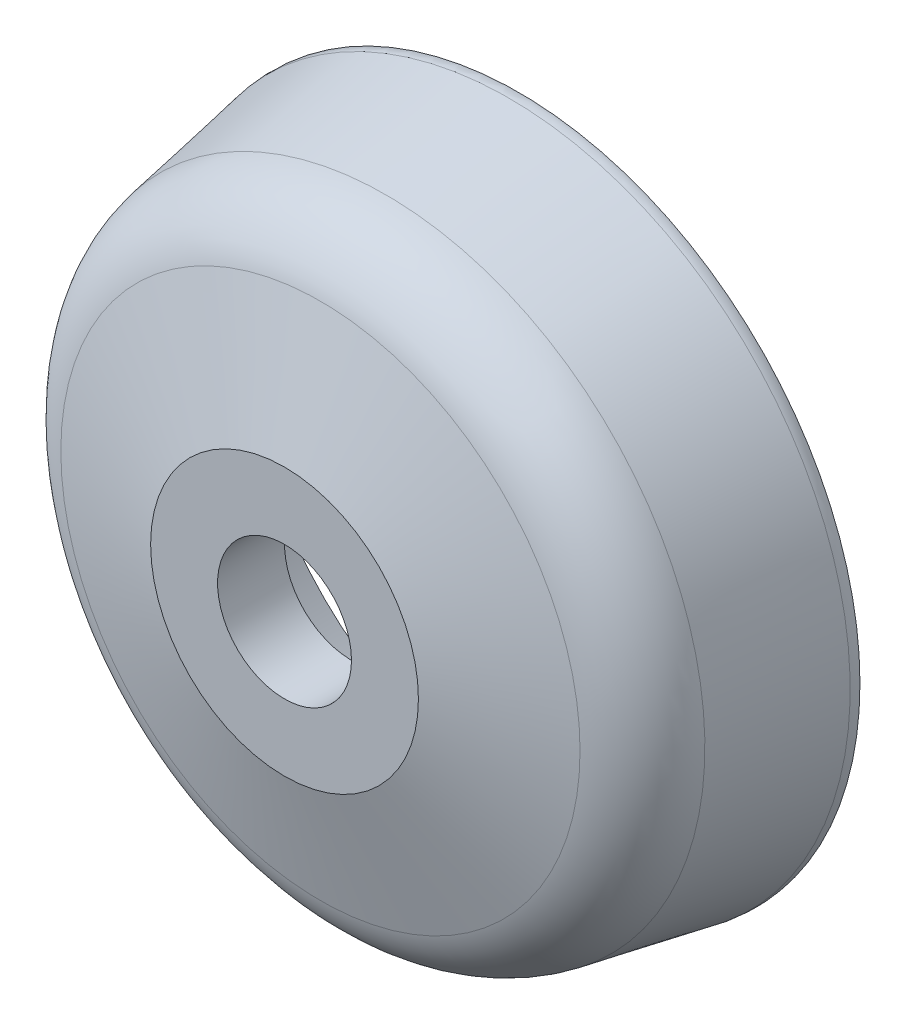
ISO-10303-21;
HEADER;
FILE_DESCRIPTION(('STEP AP214'),'2;1');
FILE_NAME('part.step','',(''),(''),'','','');
FILE_SCHEMA(('AUTOMOTIVE_DESIGN { 1 0 10303 214 1 1 1 1 }'));
ENDSEC;
DATA;
#1=APPLICATION_CONTEXT('core data for automotive mechanical design processes');
#2=APPLICATION_PROTOCOL_DEFINITION('international standard','automotive_design',2000,#1);
#3=PRODUCT_CONTEXT('',#1,'mechanical');
#4=PRODUCT('Part','Part','',(#3));
#5=PRODUCT_RELATED_PRODUCT_CATEGORY('part','',(#4));
#6=PRODUCT_DEFINITION_FORMATION('','',#4);
#7=PRODUCT_DEFINITION_CONTEXT('part definition',#1,'design');
#8=PRODUCT_DEFINITION('design','',#6,#7);
#9=PRODUCT_DEFINITION_SHAPE('','',#8);
#10=(LENGTH_UNIT() NAMED_UNIT(*) SI_UNIT(.MILLI.,.METRE.));
#11=(NAMED_UNIT(*) PLANE_ANGLE_UNIT() SI_UNIT($,.RADIAN.));
#12=(NAMED_UNIT(*) SI_UNIT($,.STERADIAN.) SOLID_ANGLE_UNIT());
#13=UNCERTAINTY_MEASURE_WITH_UNIT(LENGTH_MEASURE(1.E-05),#10,'distance_accuracy_value','');
#14=(GEOMETRIC_REPRESENTATION_CONTEXT(3) GLOBAL_UNCERTAINTY_ASSIGNED_CONTEXT((#13)) GLOBAL_UNIT_ASSIGNED_CONTEXT((#10,
#11,#12)) REPRESENTATION_CONTEXT('',''));
#15=CARTESIAN_POINT('',(0.,0.,0.));
#16=DIRECTION('',(0.,0.,1.));
#17=DIRECTION('',(1.,0.,0.));
#18=AXIS2_PLACEMENT_3D('',#15,#16,#17);
#19=CARTESIAN_POINT('',(300.5,145.,16.));
#20=DIRECTION('',(0.,0.,1.));
#21=DIRECTION('',(1.,0.,0.));
#22=AXIS2_PLACEMENT_3D('',#19,#20,#21);
#23=PLANE('',#22);
#24=CARTESIAN_POINT('',(296.5,145.,16.));
#25=DIRECTION('',(0.,0.,-1.));
#26=DIRECTION('',(-1.,0.,0.));
#27=AXIS2_PLACEMENT_3D('',#24,#25,#26);
#28=CIRCLE('',#27,4.);
#29=CARTESIAN_POINT('',(300.5,145.,16.));
#30=VERTEX_POINT('',#29);
#31=EDGE_CURVE('E34',#30,#30,#28,.F.);
#32=ORIENTED_EDGE('',*,*,#31,.T.);
#33=EDGE_LOOP('',(#32));
#34=FACE_BOUND('',#33,.T.);
#35=CARTESIAN_POINT('',(296.5,145.,16.0000000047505));
#36=DIRECTION('',(0.,0.,-1.));
#37=DIRECTION('',(-1.,0.,0.));
#38=AXIS2_PLACEMENT_3D('',#35,#36,#37);
#39=CIRCLE('',#38,7.43978022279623);
#40=CARTESIAN_POINT('',(289.060219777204,145.,16.0000000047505));
#41=VERTEX_POINT('',#40);
#42=EDGE_CURVE('E19',#41,#41,#39,.T.);
#43=ORIENTED_EDGE('',*,*,#42,.T.);
#44=EDGE_LOOP('',(#43));
#45=FACE_BOUND('',#44,.T.);
#46=ADVANCED_FACE('F16',(#34,#45),#23,.F.);
#47=CARTESIAN_POINT('',(296.5,145.,14.0080630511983));
#48=DIRECTION('',(0.,0.,-1.));
#49=DIRECTION('',(-1.,0.,0.));
#50=AXIS2_PLACEMENT_3D('',#47,#48,#49);
#51=CONICAL_SURFACE('',#50,14.411559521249,1.29249666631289);
#52=CARTESIAN_POINT('',(296.5,145.,14.0080630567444));
#53=DIRECTION('',(0.,0.,-1.));
#54=DIRECTION('',(-1.,0.,0.));
#55=AXIS2_PLACEMENT_3D('',#52,#53,#54);
#56=CIRCLE('',#55,14.4115595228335);
#57=CARTESIAN_POINT('',(282.088440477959,145.,14.0080630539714));
#58=VERTEX_POINT('',#57);
#59=EDGE_CURVE('E118',#58,#58,#56,.T.);
#60=ORIENTED_EDGE('',*,*,#59,.T.);
#61=EDGE_LOOP('',(#60));
#62=FACE_BOUND('',#61,.T.);
#63=ORIENTED_EDGE('',*,*,#42,.F.);
#64=EDGE_LOOP('',(#63));
#65=FACE_BOUND('',#64,.T.);
#66=ADVANCED_FACE('F143',(#62,#65),#51,.F.);
#67=CARTESIAN_POINT('',(296.5,145.,20.));
#68=DIRECTION('',(0.,0.,-1.));
#69=DIRECTION('',(-1.,0.,0.));
#70=AXIS2_PLACEMENT_3D('',#67,#68,#69);
#71=CYLINDRICAL_SURFACE('',#70,4.);
#72=CARTESIAN_POINT('',(296.5,145.,20.));
#73=DIRECTION('',(0.,0.,-1.));
#74=DIRECTION('',(-1.,0.,0.));
#75=AXIS2_PLACEMENT_3D('',#72,#73,#74);
#76=CIRCLE('',#75,4.);
#77=CARTESIAN_POINT('',(300.5,145.,20.));
#78=VERTEX_POINT('',#77);
#79=EDGE_CURVE('E120',#78,#78,#76,.T.);
#80=ORIENTED_EDGE('',*,*,#79,.F.);
#81=EDGE_LOOP('',(#80));
#82=FACE_BOUND('',#81,.T.);
#83=ORIENTED_EDGE('',*,*,#31,.F.);
#84=EDGE_LOOP('',(#83));
#85=FACE_BOUND('',#84,.T.);
#86=ADVANCED_FACE('F111',(#82,#85),#71,.F.);
#87=CARTESIAN_POINT('',(296.5,145.,13.0465391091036));
#88=DIRECTION('',(0.,0.,-1.));
#89=DIRECTION('',(-1.,0.,0.));
#90=AXIS2_PLACEMENT_3D('',#87,#88,#89);
#91=TOROIDAL_SURFACE('',#90,14.1368383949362,1.);
#92=CARTESIAN_POINT('',(296.5,145.,13.2254245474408));
#93=DIRECTION('',(0.,0.,-1.));
#94=DIRECTION('',(1.,0.,0.));
#95=AXIS2_PLACEMENT_3D('',#92,#93,#94);
#96=CIRCLE('',#95,15.1207083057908);
#97=CARTESIAN_POINT('',(296.5,129.879291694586,13.2254245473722));
#98=VERTEX_POINT('',#97);
#99=EDGE_CURVE('E129',#98,#98,#96,.T.);
#100=ORIENTED_EDGE('',*,*,#99,.T.);
#101=EDGE_LOOP('',(#100));
#102=FACE_BOUND('',#101,.T.);
#103=ORIENTED_EDGE('',*,*,#59,.F.);
#104=EDGE_LOOP('',(#103));
#105=FACE_BOUND('',#104,.T.);
#106=ADVANCED_FACE('F106',(#102,#105),#91,.F.);
#107=CARTESIAN_POINT('',(300.5,145.,20.));
#108=DIRECTION('',(0.,0.,1.));
#109=DIRECTION('',(1.,0.,0.));
#110=AXIS2_PLACEMENT_3D('',#107,#108,#109);
#111=PLANE('',#110);
#112=ORIENTED_EDGE('',*,*,#79,.T.);
#113=EDGE_LOOP('',(#112));
#114=FACE_BOUND('',#113,.T.);
#115=CARTESIAN_POINT('',(296.5,145.,20.0000000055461));
#116=DIRECTION('',(0.,0.,-1.));
#117=DIRECTION('',(-1.,0.,0.));
#118=AXIS2_PLACEMENT_3D('',#115,#116,#117);
#119=CIRCLE('',#118,8.00000000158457);
#120=CARTESIAN_POINT('',(288.499999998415,145.,20.0000000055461));
#121=VERTEX_POINT('',#120);
#122=EDGE_CURVE('E126',#121,#121,#119,.T.);
#123=ORIENTED_EDGE('',*,*,#122,.F.);
#124=EDGE_LOOP('',(#123));
#125=FACE_BOUND('',#124,.T.);
#126=ADVANCED_FACE('F102',(#114,#125),#111,.T.);
#127=CARTESIAN_POINT('',(296.5,145.,5.99999999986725));
#128=DIRECTION('',(0.,0.,-1.));
#129=DIRECTION('',(0.,1.,0.));
#130=AXIS2_PLACEMENT_3D('',#127,#128,#129);
#131=CONICAL_SURFACE('',#130,16.4344218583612,0.179853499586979);
#132=ORIENTED_EDGE('',*,*,#99,.F.);
#133=EDGE_LOOP('',(#132));
#134=FACE_BOUND('',#133,.T.);
#135=CARTESIAN_POINT('',(296.5,145.,5.99999999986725));
#136=DIRECTION('',(0.,0.,-1.));
#137=DIRECTION('',(0.,1.,0.));
#138=AXIS2_PLACEMENT_3D('',#135,#136,#137);
#139=CIRCLE('',#138,16.4344218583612);
#140=CARTESIAN_POINT('',(280.065578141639,145.,5.99999999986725));
#141=VERTEX_POINT('',#140);
#142=EDGE_CURVE('E123',#141,#141,#139,.F.);
#143=ORIENTED_EDGE('',*,*,#142,.F.);
#144=EDGE_LOOP('',(#143));
#145=FACE_BOUND('',#144,.T.);
#146=ADVANCED_FACE('F98',(#134,#145),#131,.F.);
#147=CARTESIAN_POINT('',(296.5,145.,17.8541588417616));
#148=DIRECTION('',(0.,0.,-1.));
#149=DIRECTION('',(-1.,0.,0.));
#150=AXIS2_PLACEMENT_3D('',#147,#148,#149);
#151=CONICAL_SURFACE('',#150,15.5104440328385,1.29249666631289);
#152=CARTESIAN_POINT('',(296.5,145.,17.8541588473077));
#153=DIRECTION('',(0.,0.,-1.));
#154=DIRECTION('',(-1.,0.,0.));
#155=AXIS2_PLACEMENT_3D('',#152,#153,#154);
#156=CIRCLE('',#155,15.5104440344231);
#157=CARTESIAN_POINT('',(280.989555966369,145.,17.8541588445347));
#158=VERTEX_POINT('',#157);
#159=EDGE_CURVE('E73',#158,#158,#156,.T.);
#160=ORIENTED_EDGE('',*,*,#159,.F.);
#161=EDGE_LOOP('',(#160));
#162=FACE_BOUND('',#161,.T.);
#163=ORIENTED_EDGE('',*,*,#122,.T.);
#164=EDGE_LOOP('',(#163));
#165=FACE_BOUND('',#164,.T.);
#166=ADVANCED_FACE('F94',(#162,#165),#151,.T.);
#167=CARTESIAN_POINT('',(306.689764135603,145.,6.));
#168=DIRECTION('',(0.,0.,-1.));
#169=DIRECTION('',(-1.,0.,0.));
#170=AXIS2_PLACEMENT_3D('',#167,#168,#169);
#171=PLANE('',#170);
#172=ORIENTED_EDGE('',*,*,#142,.T.);
#173=EDGE_LOOP('',(#172));
#174=FACE_BOUND('',#173,.T.);
#175=CARTESIAN_POINT('',(296.5,145.,6.));
#176=DIRECTION('',(0.,0.,-1.));
#177=DIRECTION('',(-1.,0.,0.));
#178=AXIS2_PLACEMENT_3D('',#175,#176,#177);
#179=CIRCLE('',#178,20.3795282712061);
#180=CARTESIAN_POINT('',(316.879528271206,145.,6.));
#181=VERTEX_POINT('',#180);
#182=EDGE_CURVE('E70',#181,#181,#179,.F.);
#183=ORIENTED_EDGE('',*,*,#182,.F.);
#184=EDGE_LOOP('',(#183));
#185=FACE_BOUND('',#184,.T.);
#186=ADVANCED_FACE('F91',(#174,#185),#171,.T.);
#187=CARTESIAN_POINT('',(296.5,145.,13.0465391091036));
#188=DIRECTION('',(0.,0.,-1.));
#189=DIRECTION('',(-1.,0.,0.));
#190=AXIS2_PLACEMENT_3D('',#187,#188,#189);
#191=TOROIDAL_SURFACE('',#190,14.1368383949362,5.);
#192=CARTESIAN_POINT('',(296.5,145.,13.9409663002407));
#193=DIRECTION('',(0.,0.,-1.));
#194=DIRECTION('',(1.,0.,0.));
#195=AXIS2_PLACEMENT_3D('',#192,#193,#194);
#196=CIRCLE('',#195,19.0561879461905);
#197=CARTESIAN_POINT('',(296.5,125.943812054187,13.9409663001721));
#198=VERTEX_POINT('',#197);
#199=EDGE_CURVE('E24',#198,#198,#196,.T.);
#200=ORIENTED_EDGE('',*,*,#199,.F.);
#201=EDGE_LOOP('',(#200));
#202=FACE_BOUND('',#201,.T.);
#203=ORIENTED_EDGE('',*,*,#159,.T.);
#204=EDGE_LOOP('',(#203));
#205=FACE_BOUND('',#204,.T.);
#206=ADVANCED_FACE('F87',(#202,#205),#191,.T.);
#207=CARTESIAN_POINT('',(296.5,145.,6.32785951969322));
#208=DIRECTION('',(0.,0.,-1.));
#209=DIRECTION('',(-1.,0.,0.));
#210=AXIS2_PLACEMENT_3D('',#207,#208,#209);
#211=TOROIDAL_SURFACE('',#210,18.9157973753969,1.5);
#212=ORIENTED_EDGE('',*,*,#182,.T.);
#213=EDGE_LOOP('',(#212));
#214=FACE_BOUND('',#213,.T.);
#215=CARTESIAN_POINT('',(296.5,145.,6.59618767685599));
#216=DIRECTION('',(0.,0.,-1.));
#217=DIRECTION('',(1.,0.,0.));
#218=AXIS2_PLACEMENT_3D('',#215,#216,#217);
#219=CIRCLE('',#218,20.3916022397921);
#220=CARTESIAN_POINT('',(276.108397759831,145.,6.5961876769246));
#221=VERTEX_POINT('',#220);
#222=EDGE_CURVE('E11',#221,#221,#219,.F.);
#223=ORIENTED_EDGE('',*,*,#222,.F.);
#224=EDGE_LOOP('',(#223));
#225=FACE_BOUND('',#224,.T.);
#226=ADVANCED_FACE('F62',(#214,#225),#211,.T.);
#227=CARTESIAN_POINT('',(296.5,145.,6.59618767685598));
#228=DIRECTION('',(0.,0.,-1.));
#229=DIRECTION('',(0.,1.,0.));
#230=AXIS2_PLACEMENT_3D('',#227,#228,#229);
#231=CONICAL_SURFACE('',#230,20.3916022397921,0.179853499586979);
#232=ORIENTED_EDGE('',*,*,#222,.T.);
#233=EDGE_LOOP('',(#232));
#234=FACE_BOUND('',#233,.T.);
#235=ORIENTED_EDGE('',*,*,#199,.T.);
#236=EDGE_LOOP('',(#235));
#237=FACE_BOUND('',#236,.T.);
#238=ADVANCED_FACE('F64',(#234,#237),#231,.T.);
#239=CLOSED_SHELL('',(#46,#66,#86,#106,#126,#146,#166,#186,#206,#226,#238));
#240=MANIFOLD_SOLID_BREP('B1',#239);
#241=ADVANCED_BREP_SHAPE_REPRESENTATION('',(#18,#240),#14);
#242=SHAPE_DEFINITION_REPRESENTATION(#9,#241);
ENDSEC;
END-ISO-10303-21;
